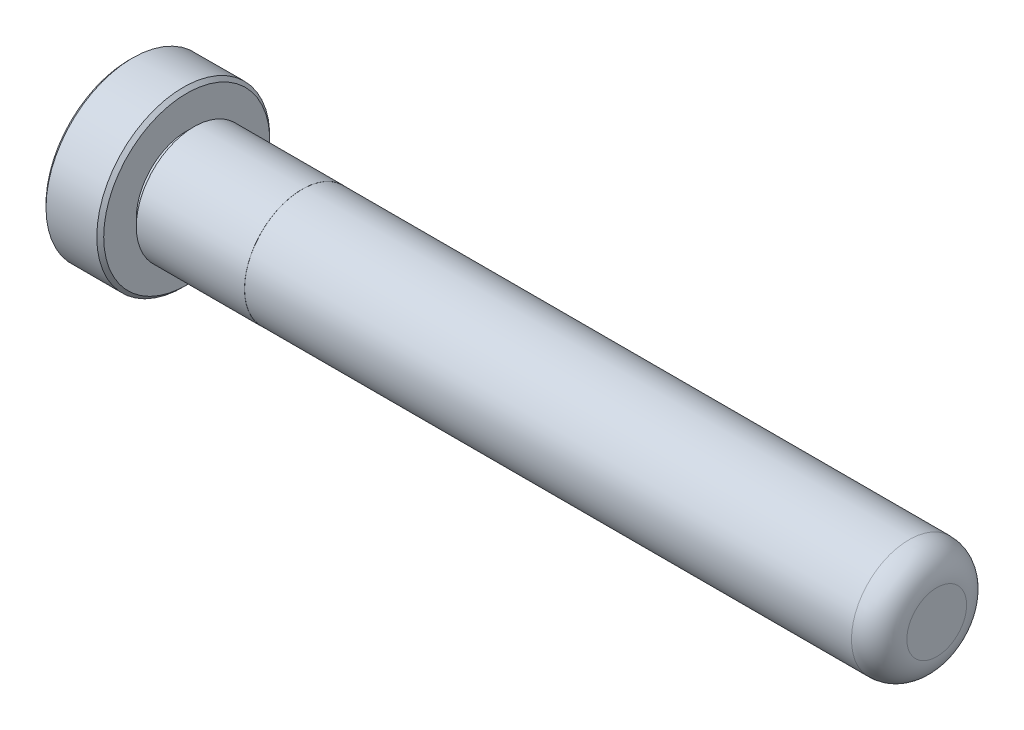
ISO-10303-21;
HEADER;
FILE_DESCRIPTION(('STEP AP214'),'2;1');
FILE_NAME('part.step','',(''),(''),'','','');
FILE_SCHEMA(('AUTOMOTIVE_DESIGN { 1 0 10303 214 1 1 1 1 }'));
ENDSEC;
DATA;
#1=APPLICATION_CONTEXT('core data for automotive mechanical design processes');
#2=APPLICATION_PROTOCOL_DEFINITION('international standard','automotive_design',2000,#1);
#3=PRODUCT_CONTEXT('',#1,'mechanical');
#4=PRODUCT('Part','Part','',(#3));
#5=PRODUCT_RELATED_PRODUCT_CATEGORY('part','',(#4));
#6=PRODUCT_DEFINITION_FORMATION('','',#4);
#7=PRODUCT_DEFINITION_CONTEXT('part definition',#1,'design');
#8=PRODUCT_DEFINITION('design','',#6,#7);
#9=PRODUCT_DEFINITION_SHAPE('','',#8);
#10=(LENGTH_UNIT() NAMED_UNIT(*) SI_UNIT(.MILLI.,.METRE.));
#11=(NAMED_UNIT(*) PLANE_ANGLE_UNIT() SI_UNIT($,.RADIAN.));
#12=(NAMED_UNIT(*) SI_UNIT($,.STERADIAN.) SOLID_ANGLE_UNIT());
#13=UNCERTAINTY_MEASURE_WITH_UNIT(LENGTH_MEASURE(1.E-05),#10,'distance_accuracy_value','');
#14=(GEOMETRIC_REPRESENTATION_CONTEXT(3) GLOBAL_UNCERTAINTY_ASSIGNED_CONTEXT((#13)) GLOBAL_UNIT_ASSIGNED_CONTEXT((#10,
#11,#12)) REPRESENTATION_CONTEXT('',''));
#15=CARTESIAN_POINT('',(0.,0.,0.));
#16=DIRECTION('',(0.,0.,1.));
#17=DIRECTION('',(1.,0.,0.));
#18=AXIS2_PLACEMENT_3D('',#15,#16,#17);
#19=CARTESIAN_POINT('',(0.,0.,0.));
#20=DIRECTION('',(1.,0.,0.));
#21=DIRECTION('',(0.,0.,-1.));
#22=AXIS2_PLACEMENT_3D('',#19,#20,#21);
#23=PLANE('',#22);
#24=CARTESIAN_POINT('',(0.,0.,0.));
#25=DIRECTION('',(1.,0.,0.));
#26=DIRECTION('',(0.,0.,-1.));
#27=AXIS2_PLACEMENT_3D('',#24,#25,#26);
#28=CIRCLE('',#27,9.14399999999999);
#29=CARTESIAN_POINT('',(0.,0.,-9.14399999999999));
#30=VERTEX_POINT('',#29);
#31=EDGE_CURVE('E10',#30,#30,#28,.F.);
#32=ORIENTED_EDGE('',*,*,#31,.T.);
#33=EDGE_LOOP('',(#32));
#34=FACE_BOUND('',#33,.T.);
#35=ADVANCED_FACE('F31',(#34),#23,.F.);
#36=CARTESIAN_POINT('',(-40.4016481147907,0.,0.));
#37=DIRECTION('',(-1.,0.,0.));
#38=DIRECTION('',(0.,0.,1.));
#39=AXIS2_PLACEMENT_3D('',#36,#37,#38);
#40=CYLINDRICAL_SURFACE('',#39,9.525);
#41=CARTESIAN_POINT('',(5.96899999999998,0.,0.));
#42=DIRECTION('',(-1.,0.,0.));
#43=DIRECTION('',(0.,0.,1.));
#44=AXIS2_PLACEMENT_3D('',#41,#42,#43);
#45=CIRCLE('',#44,9.525);
#46=CARTESIAN_POINT('',(5.96899999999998,0.,9.525));
#47=VERTEX_POINT('',#46);
#48=EDGE_CURVE('E42',#47,#47,#45,.T.);
#49=ORIENTED_EDGE('',*,*,#48,.T.);
#50=EDGE_LOOP('',(#49));
#51=FACE_BOUND('',#50,.T.);
#52=CARTESIAN_POINT('',(0.381000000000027,0.,0.));
#53=DIRECTION('',(1.,0.,0.));
#54=DIRECTION('',(0.,0.,-1.));
#55=AXIS2_PLACEMENT_3D('',#52,#53,#54);
#56=CIRCLE('',#55,9.525);
#57=CARTESIAN_POINT('',(0.381000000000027,0.,-9.525));
#58=VERTEX_POINT('',#57);
#59=EDGE_CURVE('E46',#58,#58,#56,.T.);
#60=ORIENTED_EDGE('',*,*,#59,.T.);
#61=EDGE_LOOP('',(#60));
#62=FACE_BOUND('',#61,.T.);
#63=ADVANCED_FACE('F91',(#51,#62),#40,.T.);
#64=CARTESIAN_POINT('',(6.35,9.525,0.));
#65=DIRECTION('',(-1.,0.,0.));
#66=DIRECTION('',(0.,0.,1.));
#67=AXIS2_PLACEMENT_3D('',#64,#65,#66);
#68=PLANE('',#67);
#69=CARTESIAN_POINT('',(6.35,0.,0.));
#70=DIRECTION('',(-1.,0.,0.));
#71=DIRECTION('',(0.,0.,1.));
#72=AXIS2_PLACEMENT_3D('',#69,#70,#71);
#73=CIRCLE('',#72,9.14399999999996);
#74=CARTESIAN_POINT('',(6.35,0.,9.14399999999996));
#75=VERTEX_POINT('',#74);
#76=EDGE_CURVE('E38',#75,#75,#73,.F.);
#77=ORIENTED_EDGE('',*,*,#76,.T.);
#78=EDGE_LOOP('',(#77));
#79=FACE_BOUND('',#78,.T.);
#80=CARTESIAN_POINT('',(6.35,0.,0.));
#81=DIRECTION('',(-1.,0.,0.));
#82=DIRECTION('',(0.,0.,1.));
#83=AXIS2_PLACEMENT_3D('',#80,#81,#82);
#84=CIRCLE('',#83,5.55625);
#85=CARTESIAN_POINT('',(6.35,0.,5.55625));
#86=VERTEX_POINT('',#85);
#87=EDGE_CURVE('E57',#86,#86,#84,.T.);
#88=ORIENTED_EDGE('',*,*,#87,.T.);
#89=EDGE_LOOP('',(#88));
#90=FACE_BOUND('',#89,.T.);
#91=ADVANCED_FACE('F96',(#79,#90),#68,.F.);
#92=CARTESIAN_POINT('',(-40.4016481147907,0.,0.));
#93=DIRECTION('',(-1.,0.,0.));
#94=DIRECTION('',(0.,0.,1.));
#95=AXIS2_PLACEMENT_3D('',#92,#93,#94);
#96=CYLINDRICAL_SURFACE('',#95,5.55625);
#97=ORIENTED_EDGE('',*,*,#87,.F.);
#98=EDGE_LOOP('',(#97));
#99=FACE_BOUND('',#98,.T.);
#100=CARTESIAN_POINT('',(7.14375,0.,0.));
#101=DIRECTION('',(-1.,0.,0.));
#102=DIRECTION('',(0.,0.,1.));
#103=AXIS2_PLACEMENT_3D('',#100,#101,#102);
#104=CIRCLE('',#103,5.55625);
#105=CARTESIAN_POINT('',(7.14375,0.,5.55625));
#106=VERTEX_POINT('',#105);
#107=EDGE_CURVE('E60',#106,#106,#104,.T.);
#108=ORIENTED_EDGE('',*,*,#107,.T.);
#109=EDGE_LOOP('',(#108));
#110=FACE_BOUND('',#109,.T.);
#111=ADVANCED_FACE('F131',(#99,#110),#96,.T.);
#112=CARTESIAN_POINT('',(7.14375,6.35,0.));
#113=DIRECTION('',(1.,0.,0.));
#114=DIRECTION('',(0.,0.,-1.));
#115=AXIS2_PLACEMENT_3D('',#112,#113,#114);
#116=PLANE('',#115);
#117=ORIENTED_EDGE('',*,*,#107,.F.);
#118=EDGE_LOOP('',(#117));
#119=FACE_BOUND('',#118,.T.);
#120=CARTESIAN_POINT('',(7.14375,0.,0.));
#121=DIRECTION('',(-1.,0.,0.));
#122=DIRECTION('',(0.,0.,1.));
#123=AXIS2_PLACEMENT_3D('',#120,#121,#122);
#124=CIRCLE('',#123,6.35);
#125=CARTESIAN_POINT('',(7.14375,0.,6.35));
#126=VERTEX_POINT('',#125);
#127=EDGE_CURVE('E63',#126,#126,#124,.T.);
#128=ORIENTED_EDGE('',*,*,#127,.T.);
#129=EDGE_LOOP('',(#128));
#130=FACE_BOUND('',#129,.T.);
#131=ADVANCED_FACE('F172',(#119,#130),#116,.F.);
#132=CARTESIAN_POINT('',(-40.4016481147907,0.,0.));
#133=DIRECTION('',(-1.,0.,0.));
#134=DIRECTION('',(0.,0.,1.));
#135=AXIS2_PLACEMENT_3D('',#132,#133,#134);
#136=CYLINDRICAL_SURFACE('',#135,6.35);
#137=ORIENTED_EDGE('',*,*,#127,.F.);
#138=EDGE_LOOP('',(#137));
#139=FACE_BOUND('',#138,.T.);
#140=CARTESIAN_POINT('',(19.05,0.,0.));
#141=DIRECTION('',(-1.,0.,0.));
#142=DIRECTION('',(0.,0.,1.));
#143=AXIS2_PLACEMENT_3D('',#140,#141,#142);
#144=CIRCLE('',#143,6.35);
#145=CARTESIAN_POINT('',(19.05,0.,6.35));
#146=VERTEX_POINT('',#145);
#147=EDGE_CURVE('E66',#146,#146,#144,.T.);
#148=ORIENTED_EDGE('',*,*,#147,.T.);
#149=EDGE_LOOP('',(#148));
#150=FACE_BOUND('',#149,.T.);
#151=ADVANCED_FACE('F87',(#139,#150),#136,.T.);
#152=CARTESIAN_POINT('',(19.05,6.35,0.));
#153=DIRECTION('',(-1.,0.,0.));
#154=DIRECTION('',(0.,0.,1.));
#155=AXIS2_PLACEMENT_3D('',#152,#153,#154);
#156=PLANE('',#155);
#157=ORIENTED_EDGE('',*,*,#147,.F.);
#158=EDGE_LOOP('',(#157));
#159=FACE_BOUND('',#158,.T.);
#160=CARTESIAN_POINT('',(19.05,0.,0.));
#161=DIRECTION('',(-1.,0.,0.));
#162=DIRECTION('',(0.,0.,1.));
#163=AXIS2_PLACEMENT_3D('',#160,#161,#162);
#164=CIRCLE('',#163,6.3373);
#165=CARTESIAN_POINT('',(19.05,0.,6.3373));
#166=VERTEX_POINT('',#165);
#167=EDGE_CURVE('E69',#166,#166,#164,.T.);
#168=ORIENTED_EDGE('',*,*,#167,.T.);
#169=EDGE_LOOP('',(#168));
#170=FACE_BOUND('',#169,.T.);
#171=ADVANCED_FACE('F73',(#159,#170),#156,.F.);
#172=CARTESIAN_POINT('',(-40.4016481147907,0.,0.));
#173=DIRECTION('',(-1.,0.,0.));
#174=DIRECTION('',(0.,0.,1.));
#175=AXIS2_PLACEMENT_3D('',#172,#173,#174);
#176=CYLINDRICAL_SURFACE('',#175,6.3373);
#177=CARTESIAN_POINT('',(85.852,0.,0.));
#178=DIRECTION('',(-1.,0.,0.));
#179=DIRECTION('',(0.,0.,1.));
#180=AXIS2_PLACEMENT_3D('',#177,#178,#179);
#181=CIRCLE('',#180,6.3373);
#182=CARTESIAN_POINT('',(85.852,0.,6.3373));
#183=VERTEX_POINT('',#182);
#184=EDGE_CURVE('E54',#183,#183,#181,.T.);
#185=ORIENTED_EDGE('',*,*,#184,.T.);
#186=EDGE_LOOP('',(#185));
#187=FACE_BOUND('',#186,.T.);
#188=ORIENTED_EDGE('',*,*,#167,.F.);
#189=EDGE_LOOP('',(#188));
#190=FACE_BOUND('',#189,.T.);
#191=ADVANCED_FACE('F75',(#187,#190),#176,.T.);
#192=CARTESIAN_POINT('',(88.9,6.3373,0.));
#193=DIRECTION('',(-1.,0.,0.));
#194=DIRECTION('',(0.,0.,1.));
#195=AXIS2_PLACEMENT_3D('',#192,#193,#194);
#196=PLANE('',#195);
#197=CARTESIAN_POINT('',(88.9,0.,0.));
#198=DIRECTION('',(-1.,0.,0.));
#199=DIRECTION('',(0.,0.,1.));
#200=AXIS2_PLACEMENT_3D('',#197,#198,#199);
#201=CIRCLE('',#200,3.2893);
#202=CARTESIAN_POINT('',(88.9,0.,3.2893));
#203=VERTEX_POINT('',#202);
#204=EDGE_CURVE('E51',#203,#203,#201,.F.);
#205=ORIENTED_EDGE('',*,*,#204,.T.);
#206=EDGE_LOOP('',(#205));
#207=FACE_BOUND('',#206,.T.);
#208=ADVANCED_FACE('F77',(#207),#196,.F.);
#209=CARTESIAN_POINT('',(85.852,0.,0.));
#210=DIRECTION('',(-1.,0.,0.));
#211=DIRECTION('',(0.,0.,1.));
#212=AXIS2_PLACEMENT_3D('',#209,#210,#211);
#213=TOROIDAL_SURFACE('',#212,3.2893,3.048);
#214=ORIENTED_EDGE('',*,*,#204,.F.);
#215=EDGE_LOOP('',(#214));
#216=FACE_BOUND('',#215,.T.);
#217=ORIENTED_EDGE('',*,*,#184,.F.);
#218=EDGE_LOOP('',(#217));
#219=FACE_BOUND('',#218,.T.);
#220=ADVANCED_FACE('F84',(#216,#219),#213,.T.);
#221=CARTESIAN_POINT('',(5.96899999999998,0.,0.));
#222=DIRECTION('',(-1.,0.,0.));
#223=DIRECTION('',(0.,0.,1.));
#224=AXIS2_PLACEMENT_3D('',#221,#222,#223);
#225=CONICAL_SURFACE('',#224,9.525,0.785398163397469);
#226=ORIENTED_EDGE('',*,*,#76,.F.);
#227=EDGE_LOOP('',(#226));
#228=FACE_BOUND('',#227,.T.);
#229=ORIENTED_EDGE('',*,*,#48,.F.);
#230=EDGE_LOOP('',(#229));
#231=FACE_BOUND('',#230,.T.);
#232=ADVANCED_FACE('F102',(#228,#231),#225,.T.);
#233=CARTESIAN_POINT('',(0.,0.,0.));
#234=DIRECTION('',(1.,0.,0.));
#235=DIRECTION('',(0.,0.,-1.));
#236=AXIS2_PLACEMENT_3D('',#233,#234,#235);
#237=CONICAL_SURFACE('',#236,9.14399999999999,0.785398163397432);
#238=ORIENTED_EDGE('',*,*,#59,.F.);
#239=EDGE_LOOP('',(#238));
#240=FACE_BOUND('',#239,.T.);
#241=ORIENTED_EDGE('',*,*,#31,.F.);
#242=EDGE_LOOP('',(#241));
#243=FACE_BOUND('',#242,.T.);
#244=ADVANCED_FACE('F33',(#240,#243),#237,.T.);
#245=CLOSED_SHELL('',(#35,#63,#91,#111,#131,#151,#171,#191,#208,#220,#232,#244));
#246=MANIFOLD_SOLID_BREP('B2',#245);
#247=ADVANCED_BREP_SHAPE_REPRESENTATION('',(#18,#246),#14);
#248=SHAPE_DEFINITION_REPRESENTATION(#9,#247);
ENDSEC;
END-ISO-10303-21;
